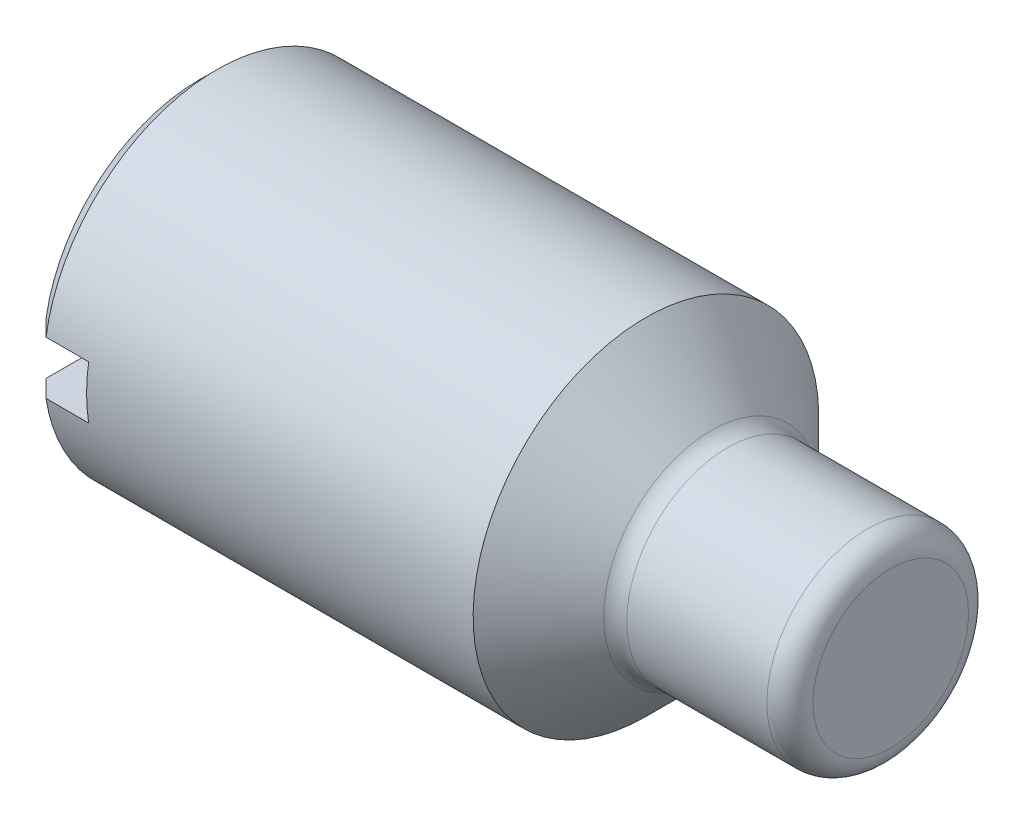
ISO-10303-21;
HEADER;
FILE_DESCRIPTION(('STEP AP214'),'2;1');
FILE_NAME('part.step','',(''),(''),'','','');
FILE_SCHEMA(('AUTOMOTIVE_DESIGN { 1 0 10303 214 1 1 1 1 }'));
ENDSEC;
DATA;
#1=APPLICATION_CONTEXT('core data for automotive mechanical design processes');
#2=APPLICATION_PROTOCOL_DEFINITION('international standard','automotive_design',2000,#1);
#3=PRODUCT_CONTEXT('',#1,'mechanical');
#4=PRODUCT('Part','Part','',(#3));
#5=PRODUCT_RELATED_PRODUCT_CATEGORY('part','',(#4));
#6=PRODUCT_DEFINITION_FORMATION('','',#4);
#7=PRODUCT_DEFINITION_CONTEXT('part definition',#1,'design');
#8=PRODUCT_DEFINITION('design','',#6,#7);
#9=PRODUCT_DEFINITION_SHAPE('','',#8);
#10=(LENGTH_UNIT() NAMED_UNIT(*) SI_UNIT(.MILLI.,.METRE.));
#11=(NAMED_UNIT(*) PLANE_ANGLE_UNIT() SI_UNIT($,.RADIAN.));
#12=(NAMED_UNIT(*) SI_UNIT($,.STERADIAN.) SOLID_ANGLE_UNIT());
#13=UNCERTAINTY_MEASURE_WITH_UNIT(LENGTH_MEASURE(1.E-05),#10,'distance_accuracy_value','');
#14=(GEOMETRIC_REPRESENTATION_CONTEXT(3) GLOBAL_UNCERTAINTY_ASSIGNED_CONTEXT((#13)) GLOBAL_UNIT_ASSIGNED_CONTEXT((#10,
#11,#12)) REPRESENTATION_CONTEXT('',''));
#15=CARTESIAN_POINT('',(0.,0.,0.));
#16=DIRECTION('',(0.,0.,1.));
#17=DIRECTION('',(1.,0.,0.));
#18=AXIS2_PLACEMENT_3D('',#15,#16,#17);
#19=CARTESIAN_POINT('',(0.,1.5,0.));
#20=DIRECTION('',(1.,0.,0.));
#21=DIRECTION('',(0.,1.,0.));
#22=AXIS2_PLACEMENT_3D('',#19,#20,#21);
#23=PLANE('',#22);
#24=DIRECTION('',(0.,0.,1.));
#25=VECTOR('',#24,1.);
#26=CARTESIAN_POINT('',(0.,0.23,0.));
#27=LINE('',#26,#25);
#28=CARTESIAN_POINT('',(0.,0.23,-1.33026313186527));
#29=VERTEX_POINT('',#28);
#30=CARTESIAN_POINT('',(0.,0.23,1.33026313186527));
#31=VERTEX_POINT('',#30);
#32=EDGE_CURVE('E136',#29,#31,#27,.T.);
#33=ORIENTED_EDGE('',*,*,#32,.T.);
#34=CARTESIAN_POINT('',(0.,0.,0.));
#35=DIRECTION('',(1.,0.,0.));
#36=DIRECTION('',(0.,1.,0.));
#37=AXIS2_PLACEMENT_3D('',#34,#35,#36);
#38=CIRCLE('',#37,1.35);
#39=EDGE_CURVE('E154',#31,#29,#38,.F.);
#40=ORIENTED_EDGE('',*,*,#39,.T.);
#41=EDGE_LOOP('',(#33,#40));
#42=FACE_BOUND('',#41,.T.);
#43=ADVANCED_FACE('F43',(#42),#23,.F.);
#44=CARTESIAN_POINT('',(6.,0.,0.));
#45=DIRECTION('',(-1.,0.,0.));
#46=DIRECTION('',(0.,-1.,0.));
#47=AXIS2_PLACEMENT_3D('',#44,#45,#46);
#48=PLANE('',#47);
#49=CARTESIAN_POINT('',(6.,0.,0.));
#50=DIRECTION('',(-1.,0.,0.));
#51=DIRECTION('',(0.,-1.,0.));
#52=AXIS2_PLACEMENT_3D('',#49,#50,#51);
#53=CIRCLE('',#52,0.675000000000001);
#54=CARTESIAN_POINT('',(6.,-0.675000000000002,0.));
#55=VERTEX_POINT('',#54);
#56=EDGE_CURVE('E146',#55,#55,#53,.F.);
#57=ORIENTED_EDGE('',*,*,#56,.T.);
#58=EDGE_LOOP('',(#57));
#59=FACE_BOUND('',#58,.T.);
#60=ADVANCED_FACE('F205',(#59),#48,.F.);
#61=CARTESIAN_POINT('',(-8.57033571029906,0.,0.));
#62=DIRECTION('',(-1.,0.,0.));
#63=DIRECTION('',(0.,-1.,0.));
#64=AXIS2_PLACEMENT_3D('',#61,#62,#63);
#65=CYLINDRICAL_SURFACE('',#64,0.875000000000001);
#66=CARTESIAN_POINT('',(5.8,0.,0.));
#67=DIRECTION('',(-1.,0.,0.));
#68=DIRECTION('',(0.,-1.,0.));
#69=AXIS2_PLACEMENT_3D('',#66,#67,#68);
#70=CIRCLE('',#69,0.875000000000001);
#71=CARTESIAN_POINT('',(5.8,-0.875000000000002,0.));
#72=VERTEX_POINT('',#71);
#73=EDGE_CURVE('E141',#72,#72,#70,.T.);
#74=ORIENTED_EDGE('',*,*,#73,.T.);
#75=EDGE_LOOP('',(#74));
#76=FACE_BOUND('',#75,.T.);
#77=CARTESIAN_POINT('',(4.58284271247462,0.,0.));
#78=DIRECTION('',(-1.,0.,0.));
#79=DIRECTION('',(0.,-1.,0.));
#80=AXIS2_PLACEMENT_3D('',#77,#78,#79);
#81=CIRCLE('',#80,0.875000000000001);
#82=CARTESIAN_POINT('',(4.58284271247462,-0.875000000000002,0.));
#83=VERTEX_POINT('',#82);
#84=EDGE_CURVE('E122',#83,#83,#81,.F.);
#85=ORIENTED_EDGE('',*,*,#84,.T.);
#86=EDGE_LOOP('',(#85));
#87=FACE_BOUND('',#86,.T.);
#88=ADVANCED_FACE('F207',(#76,#87),#65,.T.);
#89=CARTESIAN_POINT('',(4.5,0.,0.));
#90=DIRECTION('',(-1.,0.,0.));
#91=DIRECTION('',(0.,-1.,0.));
#92=AXIS2_PLACEMENT_3D('',#89,#90,#91);
#93=CONICAL_SURFACE('',#92,0.875000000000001,0.78539816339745);
#94=CARTESIAN_POINT('',(4.44142135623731,0.,0.));
#95=DIRECTION('',(-1.,0.,0.));
#96=DIRECTION('',(0.,-1.,0.));
#97=AXIS2_PLACEMENT_3D('',#94,#95,#96);
#98=CIRCLE('',#97,0.933578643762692);
#99=CARTESIAN_POINT('',(4.44142135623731,-0.933578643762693,0.));
#100=VERTEX_POINT('',#99);
#101=EDGE_CURVE('E148',#100,#100,#98,.T.);
#102=ORIENTED_EDGE('',*,*,#101,.T.);
#103=EDGE_LOOP('',(#102));
#104=FACE_BOUND('',#103,.T.);
#105=CARTESIAN_POINT('',(3.875,0.,0.));
#106=DIRECTION('',(-1.,0.,0.));
#107=DIRECTION('',(0.,-1.,0.));
#108=AXIS2_PLACEMENT_3D('',#105,#106,#107);
#109=CIRCLE('',#108,1.5);
#110=CARTESIAN_POINT('',(3.875,-1.5,0.));
#111=VERTEX_POINT('',#110);
#112=EDGE_CURVE('E135',#111,#111,#109,.T.);
#113=ORIENTED_EDGE('',*,*,#112,.F.);
#114=EDGE_LOOP('',(#113));
#115=FACE_BOUND('',#114,.T.);
#116=ADVANCED_FACE('F215',(#104,#115),#93,.T.);
#117=CARTESIAN_POINT('',(-8.57033571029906,0.,0.));
#118=DIRECTION('',(-1.,0.,0.));
#119=DIRECTION('',(0.,-1.,0.));
#120=AXIS2_PLACEMENT_3D('',#117,#118,#119);
#121=CYLINDRICAL_SURFACE('',#120,1.5);
#122=DIRECTION('',(-1.,0.,0.));
#123=VECTOR('',#122,1.);
#124=CARTESIAN_POINT('',(-8.57033571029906,0.23,-1.48226178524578));
#125=LINE('',#124,#123);
#126=CARTESIAN_POINT('',(0.52,0.23,-1.48226178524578));
#127=VERTEX_POINT('',#126);
#128=CARTESIAN_POINT('',(0.149999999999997,0.23,-1.48226178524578));
#129=VERTEX_POINT('',#128);
#130=EDGE_CURVE('E132',#127,#129,#125,.T.);
#131=ORIENTED_EDGE('',*,*,#130,.T.);
#132=CARTESIAN_POINT('',(0.149999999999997,0.,0.));
#133=DIRECTION('',(1.,0.,0.));
#134=DIRECTION('',(0.,1.,0.));
#135=AXIS2_PLACEMENT_3D('',#132,#133,#134);
#136=CIRCLE('',#135,1.5);
#137=CARTESIAN_POINT('',(0.149999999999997,0.23,1.48226178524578));
#138=VERTEX_POINT('',#137);
#139=EDGE_CURVE('E194',#129,#138,#136,.T.);
#140=ORIENTED_EDGE('',*,*,#139,.T.);
#141=DIRECTION('',(-1.,0.,0.));
#142=VECTOR('',#141,1.);
#143=CARTESIAN_POINT('',(-8.57033571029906,0.23,1.48226178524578));
#144=LINE('',#143,#142);
#145=CARTESIAN_POINT('',(0.52,0.23,1.48226178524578));
#146=VERTEX_POINT('',#145);
#147=EDGE_CURVE('E128',#138,#146,#144,.F.);
#148=ORIENTED_EDGE('',*,*,#147,.T.);
#149=CARTESIAN_POINT('',(0.52,0.,0.));
#150=DIRECTION('',(1.,0.,0.));
#151=DIRECTION('',(0.,0.,-1.));
#152=AXIS2_PLACEMENT_3D('',#149,#150,#151);
#153=CIRCLE('',#152,1.5);
#154=CARTESIAN_POINT('',(0.52,-0.23,1.48226178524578));
#155=VERTEX_POINT('',#154);
#156=EDGE_CURVE('E125',#146,#155,#153,.T.);
#157=ORIENTED_EDGE('',*,*,#156,.T.);
#158=DIRECTION('',(-1.,0.,0.));
#159=VECTOR('',#158,1.);
#160=CARTESIAN_POINT('',(-8.57033571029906,-0.23,1.48226178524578));
#161=LINE('',#160,#159);
#162=CARTESIAN_POINT('',(0.149999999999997,-0.23,1.48226178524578));
#163=VERTEX_POINT('',#162);
#164=EDGE_CURVE('E109',#155,#163,#161,.T.);
#165=ORIENTED_EDGE('',*,*,#164,.T.);
#166=CARTESIAN_POINT('',(0.149999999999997,0.,0.));
#167=DIRECTION('',(1.,0.,0.));
#168=DIRECTION('',(0.,1.,0.));
#169=AXIS2_PLACEMENT_3D('',#166,#167,#168);
#170=CIRCLE('',#169,1.5);
#171=CARTESIAN_POINT('',(0.149999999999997,-0.23,-1.48226178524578));
#172=VERTEX_POINT('',#171);
#173=EDGE_CURVE('E108',#163,#172,#170,.T.);
#174=ORIENTED_EDGE('',*,*,#173,.T.);
#175=DIRECTION('',(-1.,0.,0.));
#176=VECTOR('',#175,1.);
#177=CARTESIAN_POINT('',(-8.57033571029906,-0.23,-1.48226178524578));
#178=LINE('',#177,#176);
#179=CARTESIAN_POINT('',(0.52,-0.23,-1.48226178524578));
#180=VERTEX_POINT('',#179);
#181=EDGE_CURVE('E99',#172,#180,#178,.F.);
#182=ORIENTED_EDGE('',*,*,#181,.T.);
#183=EDGE_CURVE('E102',#180,#127,#153,.T.);
#184=ORIENTED_EDGE('',*,*,#183,.T.);
#185=EDGE_LOOP('',(#131,#140,#148,#157,#165,#174,#182,#184));
#186=FACE_BOUND('',#185,.T.);
#187=ORIENTED_EDGE('',*,*,#112,.T.);
#188=EDGE_LOOP('',(#187));
#189=FACE_BOUND('',#188,.T.);
#190=ADVANCED_FACE('F101',(#186,#189),#121,.T.);
#191=DIRECTION('',(0.,0.,-1.));
#192=VECTOR('',#191,1.);
#193=CARTESIAN_POINT('',(0.,-0.23,0.));
#194=LINE('',#193,#192);
#195=CARTESIAN_POINT('',(0.,-0.23,1.33026313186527));
#196=VERTEX_POINT('',#195);
#197=CARTESIAN_POINT('',(0.,-0.23,-1.33026313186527));
#198=VERTEX_POINT('',#197);
#199=EDGE_CURVE('E138',#196,#198,#194,.T.);
#200=ORIENTED_EDGE('',*,*,#199,.T.);
#201=CARTESIAN_POINT('',(0.,0.,0.));
#202=DIRECTION('',(1.,0.,0.));
#203=DIRECTION('',(0.,1.,0.));
#204=AXIS2_PLACEMENT_3D('',#201,#202,#203);
#205=CIRCLE('',#204,1.35);
#206=EDGE_CURVE('E191',#198,#196,#205,.F.);
#207=ORIENTED_EDGE('',*,*,#206,.T.);
#208=EDGE_LOOP('',(#200,#207));
#209=FACE_BOUND('',#208,.T.);
#210=ADVANCED_FACE('F177',(#209),#23,.F.);
#211=CARTESIAN_POINT('',(0.52,0.23,-1.5));
#212=DIRECTION('',(1.,0.,0.));
#213=DIRECTION('',(0.,0.,-1.));
#214=AXIS2_PLACEMENT_3D('',#211,#212,#213);
#215=PLANE('',#214);
#216=DIRECTION('',(0.,0.,1.));
#217=VECTOR('',#216,1.);
#218=CARTESIAN_POINT('',(0.52,0.23,-1.5));
#219=LINE('',#218,#217);
#220=EDGE_CURVE('E111',#127,#146,#219,.T.);
#221=ORIENTED_EDGE('',*,*,#220,.F.);
#222=ORIENTED_EDGE('',*,*,#183,.F.);
#223=DIRECTION('',(0.,0.,1.));
#224=VECTOR('',#223,1.);
#225=CARTESIAN_POINT('',(0.52,-0.23,-1.5));
#226=LINE('',#225,#224);
#227=EDGE_CURVE('E117',#180,#155,#226,.T.);
#228=ORIENTED_EDGE('',*,*,#227,.T.);
#229=ORIENTED_EDGE('',*,*,#156,.F.);
#230=EDGE_LOOP('',(#221,#222,#228,#229));
#231=FACE_BOUND('',#230,.T.);
#232=ADVANCED_FACE('F116',(#231),#215,.F.);
#233=CARTESIAN_POINT('',(0.,0.23,-1.5));
#234=DIRECTION('',(0.,1.,0.));
#235=DIRECTION('',(0.,0.,1.));
#236=AXIS2_PLACEMENT_3D('',#233,#234,#235);
#237=PLANE('',#236);
#238=ORIENTED_EDGE('',*,*,#32,.F.);
#239=CARTESIAN_POINT('',(0.,0.23,-1.33026313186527));
#240=CARTESIAN_POINT('',(0.0249821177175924,0.23,-1.35561388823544));
#241=CARTESIAN_POINT('',(0.0499731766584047,0.23,-1.3809558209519));
#242=CARTESIAN_POINT('',(0.0999731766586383,0.23,-1.43162203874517));
#243=CARTESIAN_POINT('',(0.124982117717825,0.23,-1.45694632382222));
#244=CARTESIAN_POINT('',(0.149999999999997,0.23,-1.48226178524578));
#245=B_SPLINE_CURVE_WITH_KNOTS('',3,(#239,#240,#241,#242,#243,#244),.UNSPECIFIED.,.F.,.F.,(4,2,
4),(0.,0.106774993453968,0.213549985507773),.UNSPECIFIED.);
#246=EDGE_CURVE('E161',#29,#129,#245,.T.);
#247=ORIENTED_EDGE('',*,*,#246,.T.);
#248=ORIENTED_EDGE('',*,*,#130,.F.);
#249=ORIENTED_EDGE('',*,*,#220,.T.);
#250=ORIENTED_EDGE('',*,*,#147,.F.);
#251=CARTESIAN_POINT('',(0.149999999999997,0.23,1.48226178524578));
#252=CARTESIAN_POINT('',(0.124982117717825,0.23,1.45694632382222));
#253=CARTESIAN_POINT('',(0.0999731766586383,0.23,1.43162203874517));
#254=CARTESIAN_POINT('',(0.0499731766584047,0.23,1.3809558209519));
#255=CARTESIAN_POINT('',(0.0249821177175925,0.23,1.35561388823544));
#256=CARTESIAN_POINT('',(0.,0.23,1.33026313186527));
#257=B_SPLINE_CURVE_WITH_KNOTS('',3,(#251,#252,#253,#254,#255,#256),.UNSPECIFIED.,.F.,.F.,(4,2,
4),(0.,0.106774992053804,0.213549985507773),.UNSPECIFIED.);
#258=EDGE_CURVE('E158',#138,#31,#257,.T.);
#259=ORIENTED_EDGE('',*,*,#258,.T.);
#260=EDGE_LOOP('',(#238,#247,#248,#249,#250,#259));
#261=FACE_BOUND('',#260,.T.);
#262=ADVANCED_FACE('F175',(#261),#237,.F.);
#263=CARTESIAN_POINT('',(0.,-0.23,-1.5));
#264=DIRECTION('',(0.,-1.,0.));
#265=DIRECTION('',(0.,0.,-1.));
#266=AXIS2_PLACEMENT_3D('',#263,#264,#265);
#267=PLANE('',#266);
#268=ORIENTED_EDGE('',*,*,#199,.F.);
#269=CARTESIAN_POINT('',(0.,-0.23,1.33026313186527));
#270=CARTESIAN_POINT('',(0.0249821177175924,-0.23,1.35561388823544));
#271=CARTESIAN_POINT('',(0.0499731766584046,-0.23,1.3809558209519));
#272=CARTESIAN_POINT('',(0.0999731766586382,-0.23,1.43162203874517));
#273=CARTESIAN_POINT('',(0.124982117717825,-0.23,1.45694632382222));
#274=CARTESIAN_POINT('',(0.149999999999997,-0.23,1.48226178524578));
#275=B_SPLINE_CURVE_WITH_KNOTS('',3,(#269,#270,#271,#272,#273,#274),.UNSPECIFIED.,.F.,.F.,(4,2,
4),(0.,0.106774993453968,0.213549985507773),.UNSPECIFIED.);
#276=EDGE_CURVE('E11',#196,#163,#275,.T.);
#277=ORIENTED_EDGE('',*,*,#276,.T.);
#278=ORIENTED_EDGE('',*,*,#164,.F.);
#279=ORIENTED_EDGE('',*,*,#227,.F.);
#280=ORIENTED_EDGE('',*,*,#181,.F.);
#281=CARTESIAN_POINT('',(0.149999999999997,-0.23,-1.48226178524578));
#282=CARTESIAN_POINT('',(0.124982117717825,-0.23,-1.45694632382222));
#283=CARTESIAN_POINT('',(0.0999731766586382,-0.23,-1.43162203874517));
#284=CARTESIAN_POINT('',(0.0499731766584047,-0.23,-1.3809558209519));
#285=CARTESIAN_POINT('',(0.0249821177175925,-0.23,-1.35561388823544));
#286=CARTESIAN_POINT('',(0.,-0.23,-1.33026313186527));
#287=B_SPLINE_CURVE_WITH_KNOTS('',3,(#281,#282,#283,#284,#285,#286),.UNSPECIFIED.,.F.,.F.,(4,2,
4),(0.,0.106774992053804,0.213549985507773),.UNSPECIFIED.);
#288=EDGE_CURVE('E60',#172,#198,#287,.T.);
#289=ORIENTED_EDGE('',*,*,#288,.T.);
#290=EDGE_LOOP('',(#268,#277,#278,#279,#280,#289));
#291=FACE_BOUND('',#290,.T.);
#292=ADVANCED_FACE('F121',(#291),#267,.F.);
#293=CARTESIAN_POINT('',(5.8,0.,0.));
#294=DIRECTION('',(-1.,0.,0.));
#295=DIRECTION('',(0.,-1.,0.));
#296=AXIS2_PLACEMENT_3D('',#293,#294,#295);
#297=TOROIDAL_SURFACE('',#296,0.675000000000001,0.2);
#298=ORIENTED_EDGE('',*,*,#56,.F.);
#299=EDGE_LOOP('',(#298));
#300=FACE_BOUND('',#299,.T.);
#301=ORIENTED_EDGE('',*,*,#73,.F.);
#302=EDGE_LOOP('',(#301));
#303=FACE_BOUND('',#302,.T.);
#304=ADVANCED_FACE('F182',(#300,#303),#297,.T.);
#305=CARTESIAN_POINT('',(4.58284271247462,0.,0.));
#306=DIRECTION('',(-1.,0.,0.));
#307=DIRECTION('',(0.,-1.,0.));
#308=AXIS2_PLACEMENT_3D('',#305,#306,#307);
#309=TOROIDAL_SURFACE('',#308,1.075,0.2);
#310=ORIENTED_EDGE('',*,*,#84,.F.);
#311=EDGE_LOOP('',(#310));
#312=FACE_BOUND('',#311,.T.);
#313=ORIENTED_EDGE('',*,*,#101,.F.);
#314=EDGE_LOOP('',(#313));
#315=FACE_BOUND('',#314,.T.);
#316=ADVANCED_FACE('F218',(#312,#315),#309,.F.);
#317=CARTESIAN_POINT('',(0.,0.,0.));
#318=DIRECTION('',(1.,0.,0.));
#319=DIRECTION('',(0.,1.,0.));
#320=AXIS2_PLACEMENT_3D('',#317,#318,#319);
#321=CONICAL_SURFACE('',#320,1.35,0.78539816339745);
#322=ORIENTED_EDGE('',*,*,#258,.F.);
#323=ORIENTED_EDGE('',*,*,#139,.F.);
#324=ORIENTED_EDGE('',*,*,#246,.F.);
#325=ORIENTED_EDGE('',*,*,#39,.F.);
#326=EDGE_LOOP('',(#322,#323,#324,#325));
#327=FACE_BOUND('',#326,.T.);
#328=ADVANCED_FACE('F169',(#327),#321,.T.);
#329=CARTESIAN_POINT('',(0.,0.,0.));
#330=DIRECTION('',(1.,0.,0.));
#331=DIRECTION('',(0.,1.,0.));
#332=AXIS2_PLACEMENT_3D('',#329,#330,#331);
#333=CONICAL_SURFACE('',#332,1.35,0.78539816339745);
#334=ORIENTED_EDGE('',*,*,#288,.F.);
#335=ORIENTED_EDGE('',*,*,#173,.F.);
#336=ORIENTED_EDGE('',*,*,#276,.F.);
#337=ORIENTED_EDGE('',*,*,#206,.F.);
#338=EDGE_LOOP('',(#334,#335,#336,#337));
#339=FACE_BOUND('',#338,.T.);
#340=ADVANCED_FACE('F44',(#339),#333,.T.);
#341=CLOSED_SHELL('',(#43,#60,#88,#116,#190,#210,#232,#262,#292,#304,#316,#328,#340));
#342=MANIFOLD_SOLID_BREP('B2',#341);
#343=ADVANCED_BREP_SHAPE_REPRESENTATION('',(#18,#342),#14);
#344=SHAPE_DEFINITION_REPRESENTATION(#9,#343);
ENDSEC;
END-ISO-10303-21;
